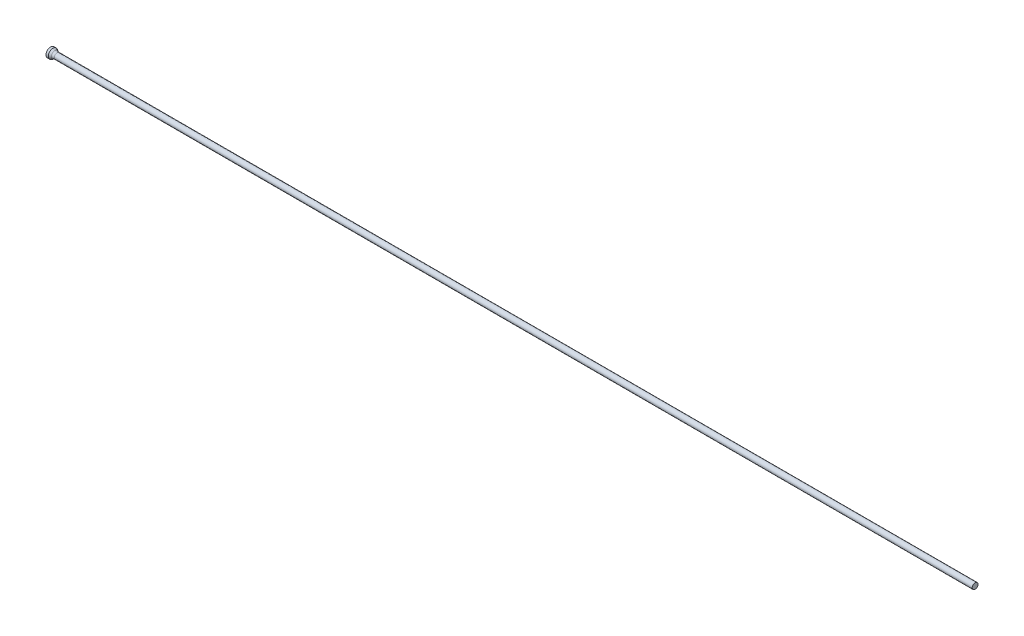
ISO-10303-21;
HEADER;
FILE_DESCRIPTION(('STEP AP214'),'2;1');
FILE_NAME('part.step','',(''),(''),'','','');
FILE_SCHEMA(('AUTOMOTIVE_DESIGN { 1 0 10303 214 1 1 1 1 }'));
ENDSEC;
DATA;
#1=APPLICATION_CONTEXT('core data for automotive mechanical design processes');
#2=APPLICATION_PROTOCOL_DEFINITION('international standard','automotive_design',2000,#1);
#3=PRODUCT_CONTEXT('',#1,'mechanical');
#4=PRODUCT('Part','Part','',(#3));
#5=PRODUCT_RELATED_PRODUCT_CATEGORY('part','',(#4));
#6=PRODUCT_DEFINITION_FORMATION('','',#4);
#7=PRODUCT_DEFINITION_CONTEXT('part definition',#1,'design');
#8=PRODUCT_DEFINITION('design','',#6,#7);
#9=PRODUCT_DEFINITION_SHAPE('','',#8);
#10=(LENGTH_UNIT() NAMED_UNIT(*) SI_UNIT(.MILLI.,.METRE.));
#11=(NAMED_UNIT(*) PLANE_ANGLE_UNIT() SI_UNIT($,.RADIAN.));
#12=(NAMED_UNIT(*) SI_UNIT($,.STERADIAN.) SOLID_ANGLE_UNIT());
#13=UNCERTAINTY_MEASURE_WITH_UNIT(LENGTH_MEASURE(1.E-05),#10,'distance_accuracy_value','');
#14=(GEOMETRIC_REPRESENTATION_CONTEXT(3) GLOBAL_UNCERTAINTY_ASSIGNED_CONTEXT((#13)) GLOBAL_UNIT_ASSIGNED_CONTEXT((#10,
#11,#12)) REPRESENTATION_CONTEXT('',''));
#15=CARTESIAN_POINT('',(0.,0.,0.));
#16=DIRECTION('',(0.,0.,1.));
#17=DIRECTION('',(1.,0.,0.));
#18=AXIS2_PLACEMENT_3D('',#15,#16,#17);
#19=CARTESIAN_POINT('',(0.,0.,0.));
#20=DIRECTION('',(1.,0.,0.));
#21=DIRECTION('',(0.,0.,-1.));
#22=AXIS2_PLACEMENT_3D('',#19,#20,#21);
#23=PLANE('',#22);
#24=CARTESIAN_POINT('',(0.,0.,0.));
#25=DIRECTION('',(-1.,0.,0.));
#26=DIRECTION('',(0.,0.,1.));
#27=AXIS2_PLACEMENT_3D('',#24,#25,#26);
#28=CIRCLE('',#27,1.);
#29=CARTESIAN_POINT('',(0.,0.,1.));
#30=VERTEX_POINT('',#29);
#31=EDGE_CURVE('E25',#30,#30,#28,.T.);
#32=ORIENTED_EDGE('',*,*,#31,.T.);
#33=EDGE_LOOP('',(#32));
#34=FACE_BOUND('',#33,.T.);
#35=ADVANCED_FACE('F14',(#34),#23,.F.);
#36=CARTESIAN_POINT('',(0.,0.,0.));
#37=DIRECTION('',(-1.,0.,0.));
#38=DIRECTION('',(0.,0.,1.));
#39=AXIS2_PLACEMENT_3D('',#36,#37,#38);
#40=CYLINDRICAL_SURFACE('',#39,1.);
#41=ORIENTED_EDGE('',*,*,#31,.F.);
#42=EDGE_LOOP('',(#41));
#43=FACE_BOUND('',#42,.T.);
#44=CARTESIAN_POINT('',(0.500480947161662,0.,0.));
#45=DIRECTION('',(-1.,0.,0.));
#46=DIRECTION('',(0.,0.,1.));
#47=AXIS2_PLACEMENT_3D('',#44,#45,#46);
#48=CIRCLE('',#47,1.);
#49=CARTESIAN_POINT('',(0.500480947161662,0.,1.));
#50=VERTEX_POINT('',#49);
#51=EDGE_CURVE('E29',#50,#50,#48,.T.);
#52=ORIENTED_EDGE('',*,*,#51,.T.);
#53=EDGE_LOOP('',(#52));
#54=FACE_BOUND('',#53,.T.);
#55=ADVANCED_FACE('F53',(#43,#54),#40,.T.);
#56=CARTESIAN_POINT('',(1.15,0.,0.));
#57=DIRECTION('',(-1.,0.,0.));
#58=DIRECTION('',(0.,0.,1.));
#59=AXIS2_PLACEMENT_3D('',#56,#57,#58);
#60=CONICAL_SURFACE('',#59,0.625,0.523598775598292);
#61=CARTESIAN_POINT('',(0.917949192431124,0.,0.));
#62=DIRECTION('',(-1.,0.,0.));
#63=DIRECTION('',(0.,0.,1.));
#64=AXIS2_PLACEMENT_3D('',#61,#62,#63);
#65=CIRCLE('',#64,0.758974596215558);
#66=CARTESIAN_POINT('',(0.917949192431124,0.,0.758974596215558));
#67=VERTEX_POINT('',#66);
#68=EDGE_CURVE('E21',#67,#67,#65,.T.);
#69=ORIENTED_EDGE('',*,*,#68,.T.);
#70=EDGE_LOOP('',(#69));
#71=FACE_BOUND('',#70,.T.);
#72=ORIENTED_EDGE('',*,*,#51,.F.);
#73=EDGE_LOOP('',(#72));
#74=FACE_BOUND('',#73,.T.);
#75=ADVANCED_FACE('F50',(#71,#74),#60,.T.);
#76=CARTESIAN_POINT('',(0.,0.,0.));
#77=DIRECTION('',(-1.,0.,0.));
#78=DIRECTION('',(0.,0.,1.));
#79=AXIS2_PLACEMENT_3D('',#76,#77,#78);
#80=CYLINDRICAL_SURFACE('',#79,0.625);
#81=CARTESIAN_POINT('',(1.41794919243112,0.,0.));
#82=DIRECTION('',(-1.,0.,0.));
#83=DIRECTION('',(0.,0.,1.));
#84=AXIS2_PLACEMENT_3D('',#81,#82,#83);
#85=CIRCLE('',#84,0.625);
#86=CARTESIAN_POINT('',(1.41794919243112,0.,0.625));
#87=VERTEX_POINT('',#86);
#88=EDGE_CURVE('E9',#87,#87,#85,.F.);
#89=ORIENTED_EDGE('',*,*,#88,.T.);
#90=EDGE_LOOP('',(#89));
#91=FACE_BOUND('',#90,.T.);
#92=CARTESIAN_POINT('',(200.,0.,0.));
#93=DIRECTION('',(-1.,0.,0.));
#94=DIRECTION('',(0.,0.,1.));
#95=AXIS2_PLACEMENT_3D('',#92,#93,#94);
#96=CIRCLE('',#95,0.625);
#97=CARTESIAN_POINT('',(200.,0.,0.625));
#98=VERTEX_POINT('',#97);
#99=EDGE_CURVE('E34',#98,#98,#96,.T.);
#100=ORIENTED_EDGE('',*,*,#99,.T.);
#101=EDGE_LOOP('',(#100));
#102=FACE_BOUND('',#101,.T.);
#103=ADVANCED_FACE('F38',(#91,#102),#80,.T.);
#104=CARTESIAN_POINT('',(200.,0.625,0.));
#105=DIRECTION('',(-1.,0.,0.));
#106=DIRECTION('',(0.,0.,1.));
#107=AXIS2_PLACEMENT_3D('',#104,#105,#106);
#108=PLANE('',#107);
#109=ORIENTED_EDGE('',*,*,#99,.F.);
#110=EDGE_LOOP('',(#109));
#111=FACE_BOUND('',#110,.T.);
#112=ADVANCED_FACE('F40',(#111),#108,.F.);
#113=CARTESIAN_POINT('',(1.41794919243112,0.,0.));
#114=DIRECTION('',(-1.,0.,0.));
#115=DIRECTION('',(0.,0.,1.));
#116=AXIS2_PLACEMENT_3D('',#113,#114,#115);
#117=TOROIDAL_SURFACE('',#116,1.625,1.);
#118=ORIENTED_EDGE('',*,*,#88,.F.);
#119=EDGE_LOOP('',(#118));
#120=FACE_BOUND('',#119,.T.);
#121=ORIENTED_EDGE('',*,*,#68,.F.);
#122=EDGE_LOOP('',(#121));
#123=FACE_BOUND('',#122,.T.);
#124=ADVANCED_FACE('F16',(#120,#123),#117,.F.);
#125=CLOSED_SHELL('',(#35,#55,#75,#103,#112,#124));
#126=MANIFOLD_SOLID_BREP('B1',#125);
#127=ADVANCED_BREP_SHAPE_REPRESENTATION('',(#18,#126),#14);
#128=SHAPE_DEFINITION_REPRESENTATION(#9,#127);
ENDSEC;
END-ISO-10303-21;
